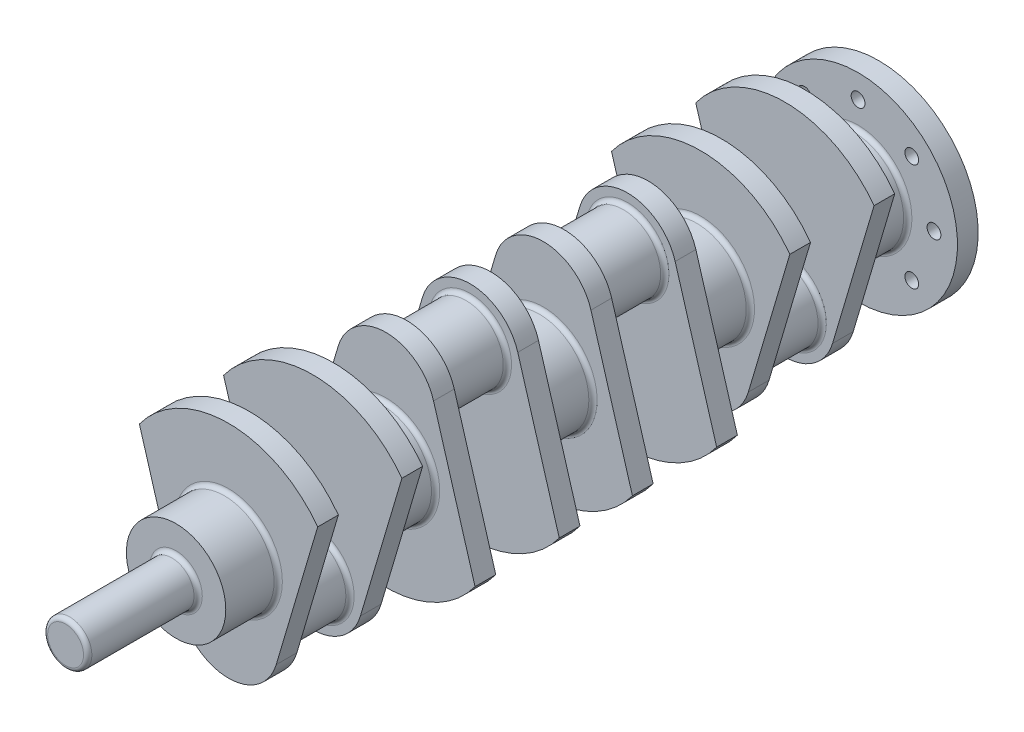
from build123d import *

# Parameters (mm, degrees)
BOSS_EXTRUDE2_DEPTH   = 15
SKETCH3_R             = 27
BOSS_EXTRUDE3_DEPTH   = 46
SKETCH5_R             = 36
BOSS_EXTRUDE5_DEPTH   = 38
BODY_MOVE_COPY1_ANGLE = 180
SKETCH6_R             = 16
BOSS_EXTRUDE6_DEPTH   = 80
SKETCH7_R             = 72
SKETCH7_R_2           = 5
BOSS_EXTRUDE7_DEPTH   = 15
FILLET1_R             = 3


with BuildPart() as part:
    # Sketch1 → Boss-Extrude2 (new body)
    with BuildSketch(Plane.XY):
        with BuildLine():
            ThreePointArc((64.569893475, 47.23059238), (0, 80), (-64.569893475, 47.23059238))
            Line((-64.569893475, 47.23059238), (-34.517510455, -54.224552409))
            ThreePointArc((-34.517510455, -54.224552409), (0, -80), (34.517510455, -54.224552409))
            Line((34.517510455, -54.224552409), (64.569893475, 47.23059238))
        make_face()
    boss_extrude2 = extrude(amount=BOSS_EXTRUDE2_DEPTH)

    # Sketch3 → Boss-Extrude3 (add)
    with BuildSketch(Plane(origin=(0, 0, 0), x_dir=(-1, 0, 0), z_dir=(0, 0, -1))):
        with Locations(Location((0, -44, 0), (0, 0, 180))):
            Circle(SKETCH3_R)
    extrude(amount=BOSS_EXTRUDE3_DEPTH)

    # Sketch5 → Boss-Extrude5 (add)
    with BuildSketch(Plane.XY.offset(15)):
        Circle(SKETCH5_R)
    boss_extrude5 = extrude(amount=BOSS_EXTRUDE5_DEPTH)

    # Mirror1: Boss-Extrude2, Boss-Extrude5 across plane
    add(boss_extrude2.mirror(Plane(origin=(0, 0, -23), x_dir=(1, 0, 0), z_dir=(0, 0, -1))))
    add(boss_extrude5.mirror(Plane(origin=(0, 0, -23), x_dir=(1, 0, 0), z_dir=(0, 0, -1))))


with BuildPart() as body_2:
    # Mirror2: mirrored copy
    add(part.part.mirror(Plane(origin=(0, 0, -80), x_dir=(1, 0, 0), z_dir=(0, 0, -1))))


with BuildPart() as body_2_1:
    # Body-Move_Copy1: moved
    add(body_2.part.rotate(Axis((0, 0, -137), (1, 0, 0)), BODY_MOVE_COPY1_ANGLE))


with BuildPart() as body_3:
    # Mirror3: mirrored copy
    add(body_2_1.part.mirror(Plane(origin=(0, 0, -194), x_dir=(1, 0, 0), z_dir=(0, 0, -1))))


with BuildPart() as body_4:
    # Mirror3 2: mirrored copy
    add(part.part.mirror(Plane(origin=(0, 0, -194), x_dir=(1, 0, 0), z_dir=(0, 0, -1))))

    # Sketch7 → Boss-Extrude7 (add)
    with BuildSketch(Plane(origin=(0, 0, -441), x_dir=(-1, 0, 0), z_dir=(0, 0, -1))):
        with Locations(Location((0, 0, 0), (0, 0, 90))):
            Circle(SKETCH7_R)
        with Locations(Location((0, 55, 0), (0, 0, 90))):
            Circle(SKETCH7_R_2, mode=Mode.SUBTRACT)
        with Locations(Location((38.890872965, 38.890872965, 0), (0, 0, 90))):
            Circle(SKETCH7_R_2, mode=Mode.SUBTRACT)
        with Locations(Location((55, 0, 0), (0, 0, 90))):
            Circle(SKETCH7_R_2, mode=Mode.SUBTRACT)
        with Locations(Location((38.890872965, -38.890872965, 0), (0, 0, 90))):
            Circle(SKETCH7_R_2, mode=Mode.SUBTRACT)
        with Locations(Location((0, -55, 0), (0, 0, 90))):
            Circle(SKETCH7_R_2, mode=Mode.SUBTRACT)
        with Locations(Location((-38.890872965, -38.890872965, 0), (0, 0, 90))):
            Circle(SKETCH7_R_2, mode=Mode.SUBTRACT)
        with Locations(Location((-55, 0, 0), (0, 0, 90))):
            Circle(SKETCH7_R_2, mode=Mode.SUBTRACT)
        with Locations(Location((-38.890872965, 38.890872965, 0), (0, 0, 90))):
            Circle(SKETCH7_R_2, mode=Mode.SUBTRACT)
    extrude(amount=BOSS_EXTRUDE7_DEPTH)


with BuildPart() as part_1:
    add(part.part)

    # Sketch6 → Boss-Extrude6 (add)
    with BuildSketch(Plane.XY.offset(53)):
        Circle(SKETCH6_R)
    extrude(amount=BOSS_EXTRUDE6_DEPTH)

    # Combine1: union body 2, body 3, body 4
    add(body_2_1.part)
    add(body_3.part)
    add(body_4.part)

    # Fillet1
    fillet1_edges = [part_1.edges().sort_by_distance(p)[0] for p in [
        (-27, -44, 0),
        (-27, -44, -46),
        (-36, 0, 15),
        (-36, 0, -61),
        (-16, 0, 53),
        (-16, 0, 133),
        (-36, 0, -99),
        (-27, 44, -114),
        (-27, 44, -160),
        (-36, 0, -175),
        (-27, 44, -274),
        (-36, 0, -289),
        (-36, 0, -213),
        (-27, 44, -228),
        (-36, 0, -403),
        (-27, -44, -388),
        (-27, -44, -342),
        (-36, 0, -441),
        (-36, 0, -327),
    ]]
    fillet(fillet1_edges, radius=FILLET1_R)


solid = part_1.part
